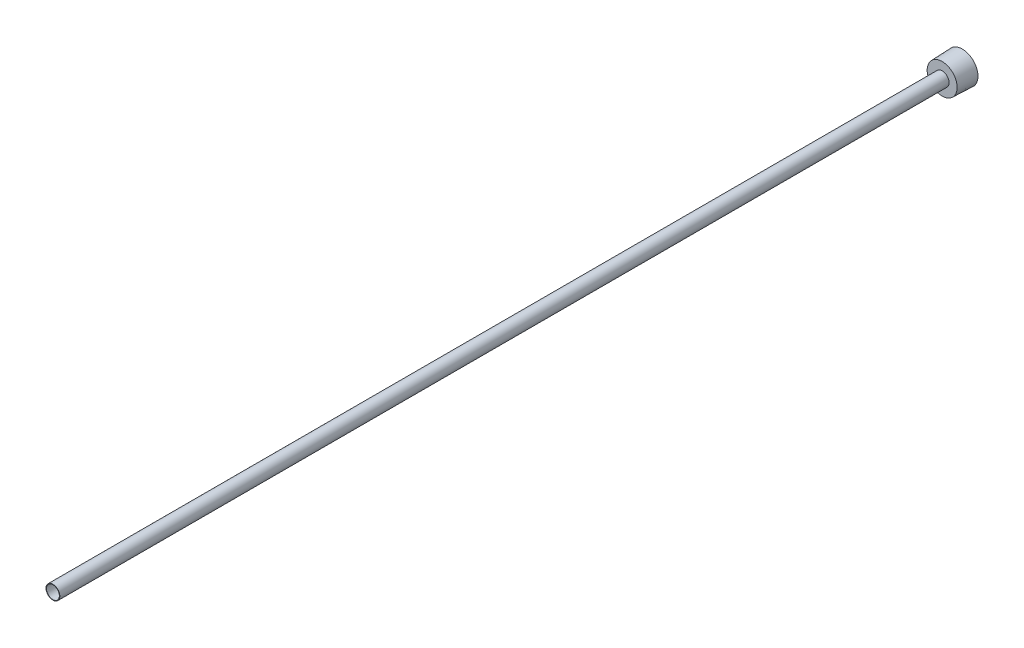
from build123d import *

# Parameters (mm, degrees)
SKETCH2_R          = 4.318
CUT_EXTRUDE1_DEPTH = 610.782244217
CUT_EXTRUDE2_DEPTH = 9.525


with BuildPart() as part:
    # Sketch1 → Revolve1 (revolve)
    with BuildSketch(Plane(origin=(0, 0, 0), x_dir=(0, 0, -1), z_dir=(1, 0, 0)), mode=Mode.PRIVATE) as revolve1_sk:
        Polygon((0, 10.541), (-13.4874, 10.049032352), (-13.4874, 4.6355), (-609.6, 4.6355), (-609.6, 0), (0, 0), align=None)
    revolve(revolve1_sk.sketch.rotate(Axis((0, 0, 223.212151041), (0, 0, -1)), 90), axis=Axis((0, 0, 223.212151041), (0, 0, -1)))

    # Sketch2 → Cut-Extrude1 (cut, through all)
    with BuildSketch(Plane.XY.offset(609.6)):
        Circle(SKETCH2_R)
    extrude(amount=-CUT_EXTRUDE1_DEPTH, mode=Mode.SUBTRACT)

    # Sketch3 → Cut-Extrude2 (cut)
    with BuildSketch(Plane(origin=(0, 0, 0), x_dir=(-1, 0, 0), z_dir=(0, 0, -1))):
        Polygon((0, -7.332348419), (6.35, -3.666174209), (6.35, 3.666174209), (0, 7.332348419), (-6.35, 3.666174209), (-6.35, -3.666174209), align=None)
    extrude(amount=-CUT_EXTRUDE2_DEPTH, mode=Mode.SUBTRACT)


solid = part.part
